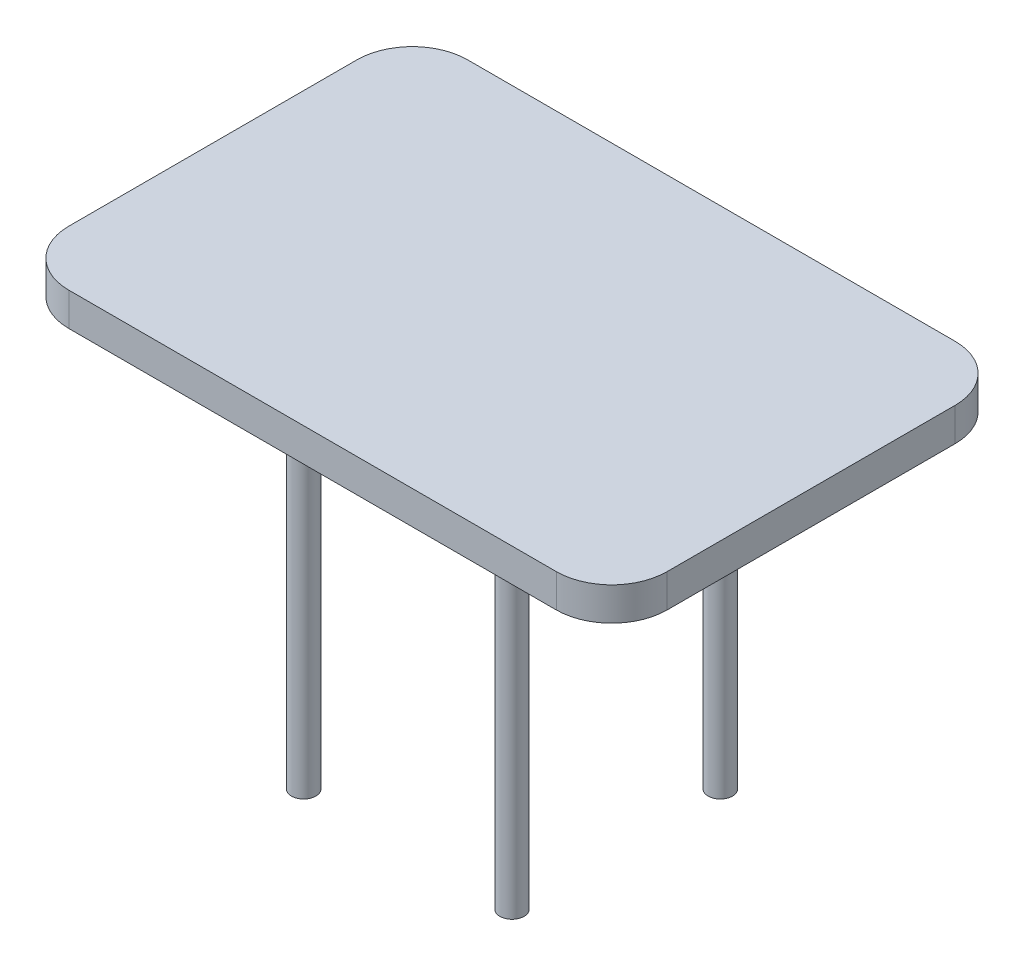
ISO-10303-21;
HEADER;
FILE_DESCRIPTION(('STEP AP214'),'2;1');
FILE_NAME('part.step','',(''),(''),'','','');
FILE_SCHEMA(('AUTOMOTIVE_DESIGN { 1 0 10303 214 1 1 1 1 }'));
ENDSEC;
DATA;
#1=APPLICATION_CONTEXT('core data for automotive mechanical design processes');
#2=APPLICATION_PROTOCOL_DEFINITION('international standard','automotive_design',2000,#1);
#3=PRODUCT_CONTEXT('',#1,'mechanical');
#4=PRODUCT('Part','Part','',(#3));
#5=PRODUCT_RELATED_PRODUCT_CATEGORY('part','',(#4));
#6=PRODUCT_DEFINITION_FORMATION('','',#4);
#7=PRODUCT_DEFINITION_CONTEXT('part definition',#1,'design');
#8=PRODUCT_DEFINITION('design','',#6,#7);
#9=PRODUCT_DEFINITION_SHAPE('','',#8);
#10=(LENGTH_UNIT() NAMED_UNIT(*) SI_UNIT(.MILLI.,.METRE.));
#11=(NAMED_UNIT(*) PLANE_ANGLE_UNIT() SI_UNIT($,.RADIAN.));
#12=(NAMED_UNIT(*) SI_UNIT($,.STERADIAN.) SOLID_ANGLE_UNIT());
#13=UNCERTAINTY_MEASURE_WITH_UNIT(LENGTH_MEASURE(1.E-05),#10,'distance_accuracy_value','');
#14=(GEOMETRIC_REPRESENTATION_CONTEXT(3) GLOBAL_UNCERTAINTY_ASSIGNED_CONTEXT((#13)) GLOBAL_UNIT_ASSIGNED_CONTEXT((#10,
#11,#12)) REPRESENTATION_CONTEXT('',''));
#15=CARTESIAN_POINT('',(0.,0.,0.));
#16=DIRECTION('',(0.,0.,1.));
#17=DIRECTION('',(1.,0.,0.));
#18=AXIS2_PLACEMENT_3D('',#15,#16,#17);
#19=CARTESIAN_POINT('',(-135.,-15.,90.));
#20=DIRECTION('',(0.,1.,0.));
#21=DIRECTION('',(0.,0.,1.));
#22=AXIS2_PLACEMENT_3D('',#19,#20,#21);
#23=PLANE('',#22);
#24=CARTESIAN_POINT('',(47.,-15.,47.));
#25=DIRECTION('',(0.,1.,0.));
#26=DIRECTION('',(0.,0.,1.));
#27=AXIS2_PLACEMENT_3D('',#24,#25,#26);
#28=CIRCLE('',#27,10.5);
#29=CARTESIAN_POINT('',(47.,-15.,57.5));
#30=VERTEX_POINT('',#29);
#31=EDGE_CURVE('E191',#30,#30,#28,.F.);
#32=ORIENTED_EDGE('',*,*,#31,.F.);
#33=EDGE_LOOP('',(#32));
#34=FACE_BOUND('',#33,.T.);
#35=CARTESIAN_POINT('',(-47.,-15.,-47.));
#36=DIRECTION('',(0.,1.,0.));
#37=DIRECTION('',(0.,0.,1.));
#38=AXIS2_PLACEMENT_3D('',#35,#36,#37);
#39=CIRCLE('',#38,10.5);
#40=CARTESIAN_POINT('',(-47.,-15.,-36.5));
#41=VERTEX_POINT('',#40);
#42=EDGE_CURVE('E177',#41,#41,#39,.F.);
#43=ORIENTED_EDGE('',*,*,#42,.F.);
#44=EDGE_LOOP('',(#43));
#45=FACE_BOUND('',#44,.T.);
#46=CARTESIAN_POINT('',(0.,-15.,0.));
#47=DIRECTION('',(0.,1.,0.));
#48=DIRECTION('',(0.,0.,1.));
#49=AXIS2_PLACEMENT_3D('',#46,#47,#48);
#50=CIRCLE('',#49,39.9999999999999);
#51=CARTESIAN_POINT('',(0.,-15.,39.9999999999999));
#52=VERTEX_POINT('',#51);
#53=EDGE_CURVE('E174',#52,#52,#50,.T.);
#54=ORIENTED_EDGE('',*,*,#53,.T.);
#55=EDGE_LOOP('',(#54));
#56=FACE_BOUND('',#55,.T.);
#57=DIRECTION('',(0.,0.,1.));
#58=VECTOR('',#57,1.);
#59=CARTESIAN_POINT('',(135.,-15.,-90.));
#60=LINE('',#59,#58);
#61=CARTESIAN_POINT('',(135.,-15.,-65.));
#62=VERTEX_POINT('',#61);
#63=CARTESIAN_POINT('',(135.,-15.,65.));
#64=VERTEX_POINT('',#63);
#65=EDGE_CURVE('E157',#62,#64,#60,.T.);
#66=ORIENTED_EDGE('',*,*,#65,.T.);
#67=CARTESIAN_POINT('',(110.,-15.,65.));
#68=DIRECTION('',(0.,1.,0.));
#69=DIRECTION('',(0.,0.,1.));
#70=AXIS2_PLACEMENT_3D('',#67,#68,#69);
#71=CIRCLE('',#70,25.);
#72=CARTESIAN_POINT('',(110.,-15.,90.));
#73=VERTEX_POINT('',#72);
#74=EDGE_CURVE('E144',#64,#73,#71,.F.);
#75=ORIENTED_EDGE('',*,*,#74,.T.);
#76=DIRECTION('',(1.,0.,0.));
#77=VECTOR('',#76,1.);
#78=CARTESIAN_POINT('',(-135.,-15.,90.));
#79=LINE('',#78,#77);
#80=CARTESIAN_POINT('',(-110.,-15.,90.));
#81=VERTEX_POINT('',#80);
#82=EDGE_CURVE('E154',#81,#73,#79,.T.);
#83=ORIENTED_EDGE('',*,*,#82,.F.);
#84=CARTESIAN_POINT('',(-110.,-15.,65.));
#85=DIRECTION('',(0.,1.,0.));
#86=DIRECTION('',(0.,0.,1.));
#87=AXIS2_PLACEMENT_3D('',#84,#85,#86);
#88=CIRCLE('',#87,25.);
#89=CARTESIAN_POINT('',(-135.,-15.,65.));
#90=VERTEX_POINT('',#89);
#91=EDGE_CURVE('E121',#81,#90,#88,.F.);
#92=ORIENTED_EDGE('',*,*,#91,.T.);
#93=DIRECTION('',(0.,0.,1.));
#94=VECTOR('',#93,1.);
#95=CARTESIAN_POINT('',(-135.,-15.,-90.));
#96=LINE('',#95,#94);
#97=CARTESIAN_POINT('',(-135.,-15.,-65.));
#98=VERTEX_POINT('',#97);
#99=EDGE_CURVE('E153',#98,#90,#96,.T.);
#100=ORIENTED_EDGE('',*,*,#99,.F.);
#101=CARTESIAN_POINT('',(-110.,-15.,-65.));
#102=DIRECTION('',(0.,1.,0.));
#103=DIRECTION('',(0.,0.,1.));
#104=AXIS2_PLACEMENT_3D('',#101,#102,#103);
#105=CIRCLE('',#104,25.);
#106=CARTESIAN_POINT('',(-110.,-15.,-90.));
#107=VERTEX_POINT('',#106);
#108=EDGE_CURVE('E54',#98,#107,#105,.F.);
#109=ORIENTED_EDGE('',*,*,#108,.T.);
#110=DIRECTION('',(1.,0.,0.));
#111=VECTOR('',#110,1.);
#112=CARTESIAN_POINT('',(-135.,-15.,-90.));
#113=LINE('',#112,#111);
#114=CARTESIAN_POINT('',(110.,-15.,-90.));
#115=VERTEX_POINT('',#114);
#116=EDGE_CURVE('E166',#107,#115,#113,.T.);
#117=ORIENTED_EDGE('',*,*,#116,.T.);
#118=CARTESIAN_POINT('',(110.,-15.,-65.));
#119=DIRECTION('',(0.,1.,0.));
#120=DIRECTION('',(0.,0.,1.));
#121=AXIS2_PLACEMENT_3D('',#118,#119,#120);
#122=CIRCLE('',#121,25.);
#123=EDGE_CURVE('E142',#115,#62,#122,.F.);
#124=ORIENTED_EDGE('',*,*,#123,.T.);
#125=EDGE_LOOP('',(#66,#75,#83,#92,#100,#109,#117,#124));
#126=FACE_BOUND('',#125,.T.);
#127=CARTESIAN_POINT('',(47.,-15.,-47.));
#128=DIRECTION('',(0.,1.,0.));
#129=DIRECTION('',(0.,0.,1.));
#130=AXIS2_PLACEMENT_3D('',#127,#128,#129);
#131=CIRCLE('',#130,10.5);
#132=CARTESIAN_POINT('',(47.,-15.,-36.5));
#133=VERTEX_POINT('',#132);
#134=EDGE_CURVE('E185',#133,#133,#131,.F.);
#135=ORIENTED_EDGE('',*,*,#134,.F.);
#136=EDGE_LOOP('',(#135));
#137=FACE_BOUND('',#136,.T.);
#138=CARTESIAN_POINT('',(-47.,-15.,47.));
#139=DIRECTION('',(0.,1.,0.));
#140=DIRECTION('',(0.,0.,1.));
#141=AXIS2_PLACEMENT_3D('',#138,#139,#140);
#142=CIRCLE('',#141,10.5);
#143=CARTESIAN_POINT('',(-47.,-15.,57.5));
#144=VERTEX_POINT('',#143);
#145=EDGE_CURVE('E197',#144,#144,#142,.F.);
#146=ORIENTED_EDGE('',*,*,#145,.F.);
#147=EDGE_LOOP('',(#146));
#148=FACE_BOUND('',#147,.T.);
#149=ADVANCED_FACE('F32',(#34,#45,#56,#126,#137,#148),#23,.F.);
#150=CARTESIAN_POINT('',(-135.,-15.,-90.));
#151=DIRECTION('',(-1.,0.,0.));
#152=DIRECTION('',(0.,0.,1.));
#153=AXIS2_PLACEMENT_3D('',#150,#151,#152);
#154=PLANE('',#153);
#155=DIRECTION('',(0.,0.,1.));
#156=VECTOR('',#155,1.);
#157=CARTESIAN_POINT('',(-135.,0.,-90.));
#158=LINE('',#157,#156);
#159=CARTESIAN_POINT('',(-135.,0.,-65.));
#160=VERTEX_POINT('',#159);
#161=CARTESIAN_POINT('',(-135.,0.,65.));
#162=VERTEX_POINT('',#161);
#163=EDGE_CURVE('E103',#160,#162,#158,.T.);
#164=ORIENTED_EDGE('',*,*,#163,.F.);
#165=DIRECTION('',(0.,1.,0.));
#166=VECTOR('',#165,1.);
#167=CARTESIAN_POINT('',(-135.,-15.,-65.));
#168=LINE('',#167,#166);
#169=EDGE_CURVE('E11',#160,#98,#168,.F.);
#170=ORIENTED_EDGE('',*,*,#169,.T.);
#171=ORIENTED_EDGE('',*,*,#99,.T.);
#172=DIRECTION('',(0.,1.,0.));
#173=VECTOR('',#172,1.);
#174=CARTESIAN_POINT('',(-135.,-15.,65.));
#175=LINE('',#174,#173);
#176=EDGE_CURVE('E40',#90,#162,#175,.T.);
#177=ORIENTED_EDGE('',*,*,#176,.T.);
#178=EDGE_LOOP('',(#164,#170,#171,#177));
#179=FACE_BOUND('',#178,.T.);
#180=ADVANCED_FACE('F151',(#179),#154,.T.);
#181=CARTESIAN_POINT('',(-135.,-15.,-90.));
#182=DIRECTION('',(0.,0.,1.));
#183=DIRECTION('',(1.,0.,0.));
#184=AXIS2_PLACEMENT_3D('',#181,#182,#183);
#185=PLANE('',#184);
#186=DIRECTION('',(1.,0.,0.));
#187=VECTOR('',#186,1.);
#188=CARTESIAN_POINT('',(-135.,0.,-90.));
#189=LINE('',#188,#187);
#190=CARTESIAN_POINT('',(-110.,0.,-90.));
#191=VERTEX_POINT('',#190);
#192=CARTESIAN_POINT('',(110.,0.,-90.));
#193=VERTEX_POINT('',#192);
#194=EDGE_CURVE('E155',#191,#193,#189,.T.);
#195=ORIENTED_EDGE('',*,*,#194,.T.);
#196=DIRECTION('',(0.,1.,0.));
#197=VECTOR('',#196,1.);
#198=CARTESIAN_POINT('',(110.,-15.,-90.));
#199=LINE('',#198,#197);
#200=EDGE_CURVE('E47',#193,#115,#199,.F.);
#201=ORIENTED_EDGE('',*,*,#200,.T.);
#202=ORIENTED_EDGE('',*,*,#116,.F.);
#203=DIRECTION('',(0.,1.,0.));
#204=VECTOR('',#203,1.);
#205=CARTESIAN_POINT('',(-110.,0.,-90.));
#206=LINE('',#205,#204);
#207=EDGE_CURVE('E146',#107,#191,#206,.T.);
#208=ORIENTED_EDGE('',*,*,#207,.T.);
#209=EDGE_LOOP('',(#195,#201,#202,#208));
#210=FACE_BOUND('',#209,.T.);
#211=ADVANCED_FACE('F249',(#210),#185,.F.);
#212=CARTESIAN_POINT('',(135.,-15.,-90.));
#213=DIRECTION('',(-1.,0.,0.));
#214=DIRECTION('',(0.,0.,1.));
#215=AXIS2_PLACEMENT_3D('',#212,#213,#214);
#216=PLANE('',#215);
#217=DIRECTION('',(0.,0.,1.));
#218=VECTOR('',#217,1.);
#219=CARTESIAN_POINT('',(135.,0.,-90.));
#220=LINE('',#219,#218);
#221=CARTESIAN_POINT('',(135.,0.,-65.));
#222=VERTEX_POINT('',#221);
#223=CARTESIAN_POINT('',(135.,0.,65.));
#224=VERTEX_POINT('',#223);
#225=EDGE_CURVE('E118',#222,#224,#220,.T.);
#226=ORIENTED_EDGE('',*,*,#225,.T.);
#227=DIRECTION('',(0.,1.,0.));
#228=VECTOR('',#227,1.);
#229=CARTESIAN_POINT('',(135.,-15.,65.));
#230=LINE('',#229,#228);
#231=EDGE_CURVE('E138',#224,#64,#230,.F.);
#232=ORIENTED_EDGE('',*,*,#231,.T.);
#233=ORIENTED_EDGE('',*,*,#65,.F.);
#234=DIRECTION('',(0.,1.,0.));
#235=VECTOR('',#234,1.);
#236=CARTESIAN_POINT('',(135.,-15.,-65.));
#237=LINE('',#236,#235);
#238=EDGE_CURVE('E135',#62,#222,#237,.T.);
#239=ORIENTED_EDGE('',*,*,#238,.T.);
#240=EDGE_LOOP('',(#226,#232,#233,#239));
#241=FACE_BOUND('',#240,.T.);
#242=ADVANCED_FACE('F425',(#241),#216,.F.);
#243=CARTESIAN_POINT('',(-135.,-15.,90.));
#244=DIRECTION('',(0.,0.,1.));
#245=DIRECTION('',(1.,0.,0.));
#246=AXIS2_PLACEMENT_3D('',#243,#244,#245);
#247=PLANE('',#246);
#248=ORIENTED_EDGE('',*,*,#82,.T.);
#249=DIRECTION('',(0.,1.,0.));
#250=VECTOR('',#249,1.);
#251=CARTESIAN_POINT('',(110.,0.,90.));
#252=LINE('',#251,#250);
#253=CARTESIAN_POINT('',(110.,0.,90.));
#254=VERTEX_POINT('',#253);
#255=EDGE_CURVE('E109',#73,#254,#252,.T.);
#256=ORIENTED_EDGE('',*,*,#255,.T.);
#257=DIRECTION('',(1.,0.,0.));
#258=VECTOR('',#257,1.);
#259=CARTESIAN_POINT('',(-135.,0.,90.));
#260=LINE('',#259,#258);
#261=CARTESIAN_POINT('',(-110.,0.,90.));
#262=VERTEX_POINT('',#261);
#263=EDGE_CURVE('E101',#262,#254,#260,.T.);
#264=ORIENTED_EDGE('',*,*,#263,.F.);
#265=DIRECTION('',(0.,1.,0.));
#266=VECTOR('',#265,1.);
#267=CARTESIAN_POINT('',(-110.,-15.,90.));
#268=LINE('',#267,#266);
#269=EDGE_CURVE('E115',#262,#81,#268,.F.);
#270=ORIENTED_EDGE('',*,*,#269,.T.);
#271=EDGE_LOOP('',(#248,#256,#264,#270));
#272=FACE_BOUND('',#271,.T.);
#273=ADVANCED_FACE('F114',(#272),#247,.T.);
#274=CARTESIAN_POINT('',(-135.,0.,90.));
#275=DIRECTION('',(0.,1.,0.));
#276=DIRECTION('',(0.,0.,1.));
#277=AXIS2_PLACEMENT_3D('',#274,#275,#276);
#278=PLANE('',#277);
#279=ORIENTED_EDGE('',*,*,#263,.T.);
#280=CARTESIAN_POINT('',(110.,0.,65.));
#281=DIRECTION('',(0.,1.,0.));
#282=DIRECTION('',(0.,0.,1.));
#283=AXIS2_PLACEMENT_3D('',#280,#281,#282);
#284=CIRCLE('',#283,25.);
#285=EDGE_CURVE('E133',#254,#224,#284,.T.);
#286=ORIENTED_EDGE('',*,*,#285,.T.);
#287=ORIENTED_EDGE('',*,*,#225,.F.);
#288=CARTESIAN_POINT('',(110.,0.,-65.));
#289=DIRECTION('',(0.,1.,0.));
#290=DIRECTION('',(0.,0.,1.));
#291=AXIS2_PLACEMENT_3D('',#288,#289,#290);
#292=CIRCLE('',#291,25.);
#293=EDGE_CURVE('E131',#222,#193,#292,.T.);
#294=ORIENTED_EDGE('',*,*,#293,.T.);
#295=ORIENTED_EDGE('',*,*,#194,.F.);
#296=CARTESIAN_POINT('',(-110.,0.,-65.));
#297=DIRECTION('',(0.,1.,0.));
#298=DIRECTION('',(0.,0.,1.));
#299=AXIS2_PLACEMENT_3D('',#296,#297,#298);
#300=CIRCLE('',#299,25.);
#301=EDGE_CURVE('E108',#191,#160,#300,.T.);
#302=ORIENTED_EDGE('',*,*,#301,.T.);
#303=ORIENTED_EDGE('',*,*,#163,.T.);
#304=CARTESIAN_POINT('',(-110.,0.,65.));
#305=DIRECTION('',(0.,1.,0.));
#306=DIRECTION('',(0.,0.,1.));
#307=AXIS2_PLACEMENT_3D('',#304,#305,#306);
#308=CIRCLE('',#307,25.);
#309=EDGE_CURVE('E98',#162,#262,#308,.T.);
#310=ORIENTED_EDGE('',*,*,#309,.T.);
#311=EDGE_LOOP('',(#279,#286,#287,#294,#295,#302,#303,#310));
#312=FACE_BOUND('',#311,.T.);
#313=ADVANCED_FACE('F100',(#312),#278,.T.);
#314=CARTESIAN_POINT('',(0.,-40.,0.));
#315=DIRECTION('',(0.,-1.,0.));
#316=DIRECTION('',(0.,0.,-1.));
#317=AXIS2_PLACEMENT_3D('',#314,#315,#316);
#318=PLANE('',#317);
#319=CARTESIAN_POINT('',(0.,-40.,0.));
#320=DIRECTION('',(0.,-1.,0.));
#321=DIRECTION('',(0.,0.,-1.));
#322=AXIS2_PLACEMENT_3D('',#319,#320,#321);
#323=CIRCLE('',#322,30.);
#324=CARTESIAN_POINT('',(0.,-40.,-30.));
#325=VERTEX_POINT('',#324);
#326=EDGE_CURVE('E161',#325,#325,#323,.T.);
#327=ORIENTED_EDGE('',*,*,#326,.T.);
#328=EDGE_LOOP('',(#327));
#329=FACE_BOUND('',#328,.T.);
#330=CARTESIAN_POINT('',(0.,-40.,0.));
#331=DIRECTION('',(0.,-1.,0.));
#332=DIRECTION('',(0.,0.,-1.));
#333=AXIS2_PLACEMENT_3D('',#330,#331,#332);
#334=CIRCLE('',#333,15.);
#335=CARTESIAN_POINT('',(0.,-40.,-15.));
#336=VERTEX_POINT('',#335);
#337=EDGE_CURVE('E273',#336,#336,#334,.T.);
#338=ORIENTED_EDGE('',*,*,#337,.F.);
#339=EDGE_LOOP('',(#338));
#340=FACE_BOUND('',#339,.T.);
#341=ADVANCED_FACE('F335',(#329,#340),#318,.T.);
#342=CARTESIAN_POINT('',(0.,-40.,0.));
#343=DIRECTION('',(0.,1.,0.));
#344=DIRECTION('',(0.,0.,1.));
#345=AXIS2_PLACEMENT_3D('',#342,#343,#344);
#346=CYLINDRICAL_SURFACE('',#345,30.);
#347=CARTESIAN_POINT('',(0.,-25.,0.));
#348=DIRECTION('',(0.,1.,0.));
#349=DIRECTION('',(0.,0.,1.));
#350=AXIS2_PLACEMENT_3D('',#347,#348,#349);
#351=CIRCLE('',#350,30.);
#352=CARTESIAN_POINT('',(0.,-25.,30.));
#353=VERTEX_POINT('',#352);
#354=EDGE_CURVE('E168',#353,#353,#351,.F.);
#355=ORIENTED_EDGE('',*,*,#354,.T.);
#356=EDGE_LOOP('',(#355));
#357=FACE_BOUND('',#356,.T.);
#358=ORIENTED_EDGE('',*,*,#326,.F.);
#359=EDGE_LOOP('',(#358));
#360=FACE_BOUND('',#359,.T.);
#361=ADVANCED_FACE('F266',(#357,#360),#346,.T.);
#362=CARTESIAN_POINT('',(0.,-40.,0.));
#363=DIRECTION('',(0.,1.,0.));
#364=DIRECTION('',(0.,0.,1.));
#365=AXIS2_PLACEMENT_3D('',#362,#363,#364);
#366=CYLINDRICAL_SURFACE('',#365,15.);
#367=ORIENTED_EDGE('',*,*,#337,.T.);
#368=EDGE_LOOP('',(#367));
#369=FACE_BOUND('',#368,.T.);
#370=CARTESIAN_POINT('',(0.,-15.,0.));
#371=DIRECTION('',(0.,-1.,0.));
#372=DIRECTION('',(0.,0.,-1.));
#373=AXIS2_PLACEMENT_3D('',#370,#371,#372);
#374=CIRCLE('',#373,15.);
#375=CARTESIAN_POINT('',(0.,-15.,-15.));
#376=VERTEX_POINT('',#375);
#377=EDGE_CURVE('E271',#376,#376,#374,.T.);
#378=ORIENTED_EDGE('',*,*,#377,.F.);
#379=EDGE_LOOP('',(#378));
#380=FACE_BOUND('',#379,.T.);
#381=ADVANCED_FACE('F257',(#369,#380),#366,.F.);
#382=ORIENTED_EDGE('',*,*,#377,.T.);
#383=EDGE_LOOP('',(#382));
#384=FACE_BOUND('',#383,.T.);
#385=ADVANCED_FACE('F245',(#384),#23,.F.);
#386=CARTESIAN_POINT('',(0.,-25.,0.));
#387=DIRECTION('',(0.,1.,0.));
#388=DIRECTION('',(0.,0.,1.));
#389=AXIS2_PLACEMENT_3D('',#386,#387,#388);
#390=CONICAL_SURFACE('',#389,30.,0.785398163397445);
#391=ORIENTED_EDGE('',*,*,#53,.F.);
#392=EDGE_LOOP('',(#391));
#393=FACE_BOUND('',#392,.T.);
#394=ORIENTED_EDGE('',*,*,#354,.F.);
#395=EDGE_LOOP('',(#394));
#396=FACE_BOUND('',#395,.T.);
#397=ADVANCED_FACE('F256',(#393,#396),#390,.T.);
#398=CARTESIAN_POINT('',(-47.,-30.,-47.));
#399=DIRECTION('',(0.,-1.,0.));
#400=DIRECTION('',(0.,0.,-1.));
#401=AXIS2_PLACEMENT_3D('',#398,#399,#400);
#402=PLANE('',#401);
#403=CARTESIAN_POINT('',(-47.,-30.,-47.));
#404=DIRECTION('',(0.,-1.,0.));
#405=DIRECTION('',(0.,0.,-1.));
#406=AXIS2_PLACEMENT_3D('',#403,#404,#405);
#407=CIRCLE('',#406,8.50000000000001);
#408=CARTESIAN_POINT('',(-47.,-30.,-55.5));
#409=VERTEX_POINT('',#408);
#410=EDGE_CURVE('E214',#409,#409,#407,.T.);
#411=ORIENTED_EDGE('',*,*,#410,.T.);
#412=EDGE_LOOP('',(#411));
#413=FACE_BOUND('',#412,.T.);
#414=CARTESIAN_POINT('',(-47.,-30.,-47.));
#415=DIRECTION('',(0.,-1.,0.));
#416=DIRECTION('',(0.,0.,-1.));
#417=AXIS2_PLACEMENT_3D('',#414,#415,#416);
#418=CIRCLE('',#417,5.5);
#419=CARTESIAN_POINT('',(-47.,-30.,-52.5));
#420=VERTEX_POINT('',#419);
#421=EDGE_CURVE('E178',#420,#420,#418,.T.);
#422=ORIENTED_EDGE('',*,*,#421,.F.);
#423=EDGE_LOOP('',(#422));
#424=FACE_BOUND('',#423,.T.);
#425=ADVANCED_FACE('F263',(#413,#424),#402,.T.);
#426=CARTESIAN_POINT('',(-47.,-30.,-47.));
#427=DIRECTION('',(0.,1.,0.));
#428=DIRECTION('',(0.,0.,1.));
#429=AXIS2_PLACEMENT_3D('',#426,#427,#428);
#430=CYLINDRICAL_SURFACE('',#429,10.5);
#431=CARTESIAN_POINT('',(-47.,-28.,-47.));
#432=DIRECTION('',(0.,-1.,0.));
#433=DIRECTION('',(0.,0.,-1.));
#434=AXIS2_PLACEMENT_3D('',#431,#432,#433);
#435=CIRCLE('',#434,10.5);
#436=CARTESIAN_POINT('',(-47.,-28.,-57.5));
#437=VERTEX_POINT('',#436);
#438=EDGE_CURVE('E217',#437,#437,#435,.F.);
#439=ORIENTED_EDGE('',*,*,#438,.T.);
#440=EDGE_LOOP('',(#439));
#441=FACE_BOUND('',#440,.T.);
#442=ORIENTED_EDGE('',*,*,#42,.T.);
#443=EDGE_LOOP('',(#442));
#444=FACE_BOUND('',#443,.T.);
#445=ADVANCED_FACE('F303',(#441,#444),#430,.T.);
#446=CARTESIAN_POINT('',(-47.,-185.,-47.));
#447=DIRECTION('',(0.,-1.,0.));
#448=DIRECTION('',(0.,0.,-1.));
#449=AXIS2_PLACEMENT_3D('',#446,#447,#448);
#450=PLANE('',#449);
#451=CARTESIAN_POINT('',(-47.,-185.,-47.));
#452=DIRECTION('',(0.,-1.,0.));
#453=DIRECTION('',(0.,0.,-1.));
#454=AXIS2_PLACEMENT_3D('',#451,#452,#453);
#455=CIRCLE('',#454,5.5);
#456=CARTESIAN_POINT('',(-47.,-185.,-52.5));
#457=VERTEX_POINT('',#456);
#458=EDGE_CURVE('E181',#457,#457,#455,.T.);
#459=ORIENTED_EDGE('',*,*,#458,.T.);
#460=EDGE_LOOP('',(#459));
#461=FACE_BOUND('',#460,.T.);
#462=ADVANCED_FACE('F289',(#461),#450,.T.);
#463=CARTESIAN_POINT('',(-47.,-185.,-47.));
#464=DIRECTION('',(0.,1.,0.));
#465=DIRECTION('',(0.,0.,1.));
#466=AXIS2_PLACEMENT_3D('',#463,#464,#465);
#467=CYLINDRICAL_SURFACE('',#466,5.5);
#468=ORIENTED_EDGE('',*,*,#421,.T.);
#469=EDGE_LOOP('',(#468));
#470=FACE_BOUND('',#469,.T.);
#471=ORIENTED_EDGE('',*,*,#458,.F.);
#472=EDGE_LOOP('',(#471));
#473=FACE_BOUND('',#472,.T.);
#474=ADVANCED_FACE('F291',(#470,#473),#467,.T.);
#475=CARTESIAN_POINT('',(47.,-30.,-47.));
#476=DIRECTION('',(0.,-1.,0.));
#477=DIRECTION('',(0.,0.,-1.));
#478=AXIS2_PLACEMENT_3D('',#475,#476,#477);
#479=PLANE('',#478);
#480=CARTESIAN_POINT('',(47.,-30.,-47.));
#481=DIRECTION('',(0.,-1.,0.));
#482=DIRECTION('',(0.,0.,-1.));
#483=AXIS2_PLACEMENT_3D('',#480,#481,#482);
#484=CIRCLE('',#483,8.50000000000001);
#485=CARTESIAN_POINT('',(47.,-30.,-55.5));
#486=VERTEX_POINT('',#485);
#487=EDGE_CURVE('E208',#486,#486,#484,.T.);
#488=ORIENTED_EDGE('',*,*,#487,.T.);
#489=EDGE_LOOP('',(#488));
#490=FACE_BOUND('',#489,.T.);
#491=CARTESIAN_POINT('',(47.,-30.,-47.));
#492=DIRECTION('',(0.,-1.,0.));
#493=DIRECTION('',(0.,0.,-1.));
#494=AXIS2_PLACEMENT_3D('',#491,#492,#493);
#495=CIRCLE('',#494,5.5);
#496=CARTESIAN_POINT('',(47.,-30.,-52.5));
#497=VERTEX_POINT('',#496);
#498=EDGE_CURVE('E182',#497,#497,#495,.T.);
#499=ORIENTED_EDGE('',*,*,#498,.F.);
#500=EDGE_LOOP('',(#499));
#501=FACE_BOUND('',#500,.T.);
#502=ADVANCED_FACE('F293',(#490,#501),#479,.T.);
#503=CARTESIAN_POINT('',(47.,-30.,-47.));
#504=DIRECTION('',(0.,1.,0.));
#505=DIRECTION('',(0.,0.,1.));
#506=AXIS2_PLACEMENT_3D('',#503,#504,#505);
#507=CYLINDRICAL_SURFACE('',#506,10.5);
#508=CARTESIAN_POINT('',(47.,-28.,-47.));
#509=DIRECTION('',(0.,-1.,0.));
#510=DIRECTION('',(0.,0.,-1.));
#511=AXIS2_PLACEMENT_3D('',#508,#509,#510);
#512=CIRCLE('',#511,10.5);
#513=CARTESIAN_POINT('',(47.,-28.,-57.5));
#514=VERTEX_POINT('',#513);
#515=EDGE_CURVE('E211',#514,#514,#512,.F.);
#516=ORIENTED_EDGE('',*,*,#515,.T.);
#517=EDGE_LOOP('',(#516));
#518=FACE_BOUND('',#517,.T.);
#519=ORIENTED_EDGE('',*,*,#134,.T.);
#520=EDGE_LOOP('',(#519));
#521=FACE_BOUND('',#520,.T.);
#522=ADVANCED_FACE('F300',(#518,#521),#507,.T.);
#523=CARTESIAN_POINT('',(47.,-185.,-47.));
#524=DIRECTION('',(0.,-1.,0.));
#525=DIRECTION('',(0.,0.,-1.));
#526=AXIS2_PLACEMENT_3D('',#523,#524,#525);
#527=PLANE('',#526);
#528=CARTESIAN_POINT('',(47.,-185.,-47.));
#529=DIRECTION('',(0.,-1.,0.));
#530=DIRECTION('',(0.,0.,-1.));
#531=AXIS2_PLACEMENT_3D('',#528,#529,#530);
#532=CIRCLE('',#531,5.5);
#533=CARTESIAN_POINT('',(47.,-185.,-52.5));
#534=VERTEX_POINT('',#533);
#535=EDGE_CURVE('E283',#534,#534,#532,.T.);
#536=ORIENTED_EDGE('',*,*,#535,.T.);
#537=EDGE_LOOP('',(#536));
#538=FACE_BOUND('',#537,.T.);
#539=ADVANCED_FACE('F307',(#538),#527,.T.);
#540=CARTESIAN_POINT('',(47.,-185.,-47.));
#541=DIRECTION('',(0.,1.,0.));
#542=DIRECTION('',(0.,0.,1.));
#543=AXIS2_PLACEMENT_3D('',#540,#541,#542);
#544=CYLINDRICAL_SURFACE('',#543,5.5);
#545=ORIENTED_EDGE('',*,*,#498,.T.);
#546=EDGE_LOOP('',(#545));
#547=FACE_BOUND('',#546,.T.);
#548=ORIENTED_EDGE('',*,*,#535,.F.);
#549=EDGE_LOOP('',(#548));
#550=FACE_BOUND('',#549,.T.);
#551=ADVANCED_FACE('F310',(#547,#550),#544,.T.);
#552=CARTESIAN_POINT('',(47.,-30.,47.));
#553=DIRECTION('',(0.,-1.,0.));
#554=DIRECTION('',(0.,0.,-1.));
#555=AXIS2_PLACEMENT_3D('',#552,#553,#554);
#556=PLANE('',#555);
#557=CARTESIAN_POINT('',(47.,-30.,47.));
#558=DIRECTION('',(0.,-1.,0.));
#559=DIRECTION('',(0.,0.,-1.));
#560=AXIS2_PLACEMENT_3D('',#557,#558,#559);
#561=CIRCLE('',#560,8.50000000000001);
#562=CARTESIAN_POINT('',(47.,-30.,38.5));
#563=VERTEX_POINT('',#562);
#564=EDGE_CURVE('E202',#563,#563,#561,.T.);
#565=ORIENTED_EDGE('',*,*,#564,.T.);
#566=EDGE_LOOP('',(#565));
#567=FACE_BOUND('',#566,.T.);
#568=CARTESIAN_POINT('',(47.,-30.,47.));
#569=DIRECTION('',(0.,-1.,0.));
#570=DIRECTION('',(0.,0.,-1.));
#571=AXIS2_PLACEMENT_3D('',#568,#569,#570);
#572=CIRCLE('',#571,5.5);
#573=CARTESIAN_POINT('',(47.,-30.,41.5));
#574=VERTEX_POINT('',#573);
#575=EDGE_CURVE('E188',#574,#574,#572,.T.);
#576=ORIENTED_EDGE('',*,*,#575,.F.);
#577=EDGE_LOOP('',(#576));
#578=FACE_BOUND('',#577,.T.);
#579=ADVANCED_FACE('F314',(#567,#578),#556,.T.);
#580=CARTESIAN_POINT('',(47.,-30.,47.));
#581=DIRECTION('',(0.,1.,0.));
#582=DIRECTION('',(0.,0.,1.));
#583=AXIS2_PLACEMENT_3D('',#580,#581,#582);
#584=CYLINDRICAL_SURFACE('',#583,10.5);
#585=CARTESIAN_POINT('',(47.,-28.,47.));
#586=DIRECTION('',(0.,-1.,0.));
#587=DIRECTION('',(0.,0.,-1.));
#588=AXIS2_PLACEMENT_3D('',#585,#586,#587);
#589=CIRCLE('',#588,10.5);
#590=CARTESIAN_POINT('',(47.,-28.,36.5));
#591=VERTEX_POINT('',#590);
#592=EDGE_CURVE('E205',#591,#591,#589,.F.);
#593=ORIENTED_EDGE('',*,*,#592,.T.);
#594=EDGE_LOOP('',(#593));
#595=FACE_BOUND('',#594,.T.);
#596=ORIENTED_EDGE('',*,*,#31,.T.);
#597=EDGE_LOOP('',(#596));
#598=FACE_BOUND('',#597,.T.);
#599=ADVANCED_FACE('F320',(#595,#598),#584,.T.);
#600=CARTESIAN_POINT('',(47.,-185.,47.));
#601=DIRECTION('',(0.,-1.,0.));
#602=DIRECTION('',(0.,0.,-1.));
#603=AXIS2_PLACEMENT_3D('',#600,#601,#602);
#604=PLANE('',#603);
#605=CARTESIAN_POINT('',(47.,-185.,47.));
#606=DIRECTION('',(0.,-1.,0.));
#607=DIRECTION('',(0.,0.,-1.));
#608=AXIS2_PLACEMENT_3D('',#605,#606,#607);
#609=CIRCLE('',#608,5.5);
#610=CARTESIAN_POINT('',(47.,-185.,41.5));
#611=VERTEX_POINT('',#610);
#612=EDGE_CURVE('E278',#611,#611,#609,.T.);
#613=ORIENTED_EDGE('',*,*,#612,.T.);
#614=EDGE_LOOP('',(#613));
#615=FACE_BOUND('',#614,.T.);
#616=ADVANCED_FACE('F316',(#615),#604,.T.);
#617=CARTESIAN_POINT('',(47.,-185.,47.));
#618=DIRECTION('',(0.,1.,0.));
#619=DIRECTION('',(0.,0.,1.));
#620=AXIS2_PLACEMENT_3D('',#617,#618,#619);
#621=CYLINDRICAL_SURFACE('',#620,5.5);
#622=ORIENTED_EDGE('',*,*,#575,.T.);
#623=EDGE_LOOP('',(#622));
#624=FACE_BOUND('',#623,.T.);
#625=ORIENTED_EDGE('',*,*,#612,.F.);
#626=EDGE_LOOP('',(#625));
#627=FACE_BOUND('',#626,.T.);
#628=ADVANCED_FACE('F319',(#624,#627),#621,.T.);
#629=CARTESIAN_POINT('',(-47.,-30.,47.));
#630=DIRECTION('',(0.,-1.,0.));
#631=DIRECTION('',(0.,0.,-1.));
#632=AXIS2_PLACEMENT_3D('',#629,#630,#631);
#633=PLANE('',#632);
#634=CARTESIAN_POINT('',(-47.,-30.,47.));
#635=DIRECTION('',(0.,-1.,0.));
#636=DIRECTION('',(0.,0.,-1.));
#637=AXIS2_PLACEMENT_3D('',#634,#635,#636);
#638=CIRCLE('',#637,8.49999999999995);
#639=CARTESIAN_POINT('',(-47.,-30.,55.5));
#640=VERTEX_POINT('',#639);
#641=EDGE_CURVE('E126',#640,#640,#638,.T.);
#642=ORIENTED_EDGE('',*,*,#641,.T.);
#643=EDGE_LOOP('',(#642));
#644=FACE_BOUND('',#643,.T.);
#645=CARTESIAN_POINT('',(-47.,-30.,47.));
#646=DIRECTION('',(0.,-1.,0.));
#647=DIRECTION('',(0.,0.,-1.));
#648=AXIS2_PLACEMENT_3D('',#645,#646,#647);
#649=CIRCLE('',#648,5.5);
#650=CARTESIAN_POINT('',(-47.,-30.,41.5));
#651=VERTEX_POINT('',#650);
#652=EDGE_CURVE('E194',#651,#651,#649,.T.);
#653=ORIENTED_EDGE('',*,*,#652,.F.);
#654=EDGE_LOOP('',(#653));
#655=FACE_BOUND('',#654,.T.);
#656=ADVANCED_FACE('F222',(#644,#655),#633,.T.);
#657=CARTESIAN_POINT('',(-47.,-30.,47.));
#658=DIRECTION('',(0.,1.,0.));
#659=DIRECTION('',(0.,0.,1.));
#660=AXIS2_PLACEMENT_3D('',#657,#658,#659);
#661=CYLINDRICAL_SURFACE('',#660,10.5);
#662=CARTESIAN_POINT('',(-47.,-27.9999999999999,47.));
#663=DIRECTION('',(0.,-1.,0.));
#664=DIRECTION('',(0.,0.,-1.));
#665=AXIS2_PLACEMENT_3D('',#662,#663,#664);
#666=CIRCLE('',#665,10.5);
#667=CARTESIAN_POINT('',(-47.,-27.9999999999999,57.5));
#668=VERTEX_POINT('',#667);
#669=EDGE_CURVE('E122',#668,#668,#666,.F.);
#670=ORIENTED_EDGE('',*,*,#669,.T.);
#671=EDGE_LOOP('',(#670));
#672=FACE_BOUND('',#671,.T.);
#673=ORIENTED_EDGE('',*,*,#145,.T.);
#674=EDGE_LOOP('',(#673));
#675=FACE_BOUND('',#674,.T.);
#676=ADVANCED_FACE('F329',(#672,#675),#661,.T.);
#677=CARTESIAN_POINT('',(-47.,-185.,47.));
#678=DIRECTION('',(0.,-1.,0.));
#679=DIRECTION('',(0.,0.,-1.));
#680=AXIS2_PLACEMENT_3D('',#677,#678,#679);
#681=PLANE('',#680);
#682=CARTESIAN_POINT('',(-47.,-185.,47.));
#683=DIRECTION('',(0.,-1.,0.));
#684=DIRECTION('',(0.,0.,-1.));
#685=AXIS2_PLACEMENT_3D('',#682,#683,#684);
#686=CIRCLE('',#685,5.5);
#687=CARTESIAN_POINT('',(-47.,-185.,41.5));
#688=VERTEX_POINT('',#687);
#689=EDGE_CURVE('E274',#688,#688,#686,.T.);
#690=ORIENTED_EDGE('',*,*,#689,.T.);
#691=EDGE_LOOP('',(#690));
#692=FACE_BOUND('',#691,.T.);
#693=ADVANCED_FACE('F325',(#692),#681,.T.);
#694=CARTESIAN_POINT('',(-47.,-185.,47.));
#695=DIRECTION('',(0.,1.,0.));
#696=DIRECTION('',(0.,0.,1.));
#697=AXIS2_PLACEMENT_3D('',#694,#695,#696);
#698=CYLINDRICAL_SURFACE('',#697,5.5);
#699=ORIENTED_EDGE('',*,*,#652,.T.);
#700=EDGE_LOOP('',(#699));
#701=FACE_BOUND('',#700,.T.);
#702=ORIENTED_EDGE('',*,*,#689,.F.);
#703=EDGE_LOOP('',(#702));
#704=FACE_BOUND('',#703,.T.);
#705=ADVANCED_FACE('F328',(#701,#704),#698,.T.);
#706=CARTESIAN_POINT('',(47.,-30.,47.));
#707=DIRECTION('',(0.,1.,0.));
#708=DIRECTION('',(0.,0.,1.));
#709=AXIS2_PLACEMENT_3D('',#706,#707,#708);
#710=CONICAL_SURFACE('',#709,8.50000000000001,0.785398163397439);
#711=ORIENTED_EDGE('',*,*,#592,.F.);
#712=EDGE_LOOP('',(#711));
#713=FACE_BOUND('',#712,.T.);
#714=ORIENTED_EDGE('',*,*,#564,.F.);
#715=EDGE_LOOP('',(#714));
#716=FACE_BOUND('',#715,.T.);
#717=ADVANCED_FACE('F332',(#713,#716),#710,.T.);
#718=CARTESIAN_POINT('',(47.,-30.,-47.));
#719=DIRECTION('',(0.,1.,0.));
#720=DIRECTION('',(0.,0.,1.));
#721=AXIS2_PLACEMENT_3D('',#718,#719,#720);
#722=CONICAL_SURFACE('',#721,8.50000000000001,0.785398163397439);
#723=ORIENTED_EDGE('',*,*,#515,.F.);
#724=EDGE_LOOP('',(#723));
#725=FACE_BOUND('',#724,.T.);
#726=ORIENTED_EDGE('',*,*,#487,.F.);
#727=EDGE_LOOP('',(#726));
#728=FACE_BOUND('',#727,.T.);
#729=ADVANCED_FACE('F238',(#725,#728),#722,.T.);
#730=CARTESIAN_POINT('',(-47.,-30.,-47.));
#731=DIRECTION('',(0.,1.,0.));
#732=DIRECTION('',(0.,0.,1.));
#733=AXIS2_PLACEMENT_3D('',#730,#731,#732);
#734=CONICAL_SURFACE('',#733,8.50000000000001,0.785398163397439);
#735=ORIENTED_EDGE('',*,*,#438,.F.);
#736=EDGE_LOOP('',(#735));
#737=FACE_BOUND('',#736,.T.);
#738=ORIENTED_EDGE('',*,*,#410,.F.);
#739=EDGE_LOOP('',(#738));
#740=FACE_BOUND('',#739,.T.);
#741=ADVANCED_FACE('F228',(#737,#740),#734,.T.);
#742=CARTESIAN_POINT('',(-47.,-30.,47.));
#743=DIRECTION('',(0.,1.,0.));
#744=DIRECTION('',(0.,0.,1.));
#745=AXIS2_PLACEMENT_3D('',#742,#743,#744);
#746=CONICAL_SURFACE('',#745,8.49999999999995,0.785398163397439);
#747=CARTESIAN_POINT('',(-47.,-27.9999999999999,57.5));
#748=CARTESIAN_POINT('',(-47.,-28.0208333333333,57.4791666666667));
#749=CARTESIAN_POINT('',(-47.,-28.0416666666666,57.4583333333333));
#750=CARTESIAN_POINT('',(-47.,-28.0833333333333,57.4166666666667));
#751=CARTESIAN_POINT('',(-47.,-28.1041666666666,57.3958333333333));
#752=CARTESIAN_POINT('',(-47.,-28.1458333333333,57.3541666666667));
#753=CARTESIAN_POINT('',(-47.,-28.1666666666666,57.3333333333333));
#754=CARTESIAN_POINT('',(-47.,-28.2083333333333,57.2916666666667));
#755=CARTESIAN_POINT('',(-47.,-28.2291666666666,57.2708333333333));
#756=CARTESIAN_POINT('',(-47.,-28.2708333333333,57.2291666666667));
#757=CARTESIAN_POINT('',(-47.,-28.2916666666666,57.2083333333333));
#758=CARTESIAN_POINT('',(-47.,-28.3333333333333,57.1666666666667));
#759=CARTESIAN_POINT('',(-47.,-28.3541666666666,57.1458333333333));
#760=CARTESIAN_POINT('',(-47.,-28.3958333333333,57.1041666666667));
#761=CARTESIAN_POINT('',(-47.,-28.4166666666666,57.0833333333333));
#762=CARTESIAN_POINT('',(-47.,-28.4583333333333,57.0416666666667));
#763=CARTESIAN_POINT('',(-47.,-28.4791666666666,57.0208333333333));
#764=CARTESIAN_POINT('',(-47.,-28.5208333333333,56.9791666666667));
#765=CARTESIAN_POINT('',(-47.,-28.5416666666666,56.9583333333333));
#766=CARTESIAN_POINT('',(-47.,-28.5833333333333,56.9166666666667));
#767=CARTESIAN_POINT('',(-47.,-28.6041666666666,56.8958333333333));
#768=CARTESIAN_POINT('',(-47.,-28.6458333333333,56.8541666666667));
#769=CARTESIAN_POINT('',(-47.,-28.6666666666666,56.8333333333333));
#770=CARTESIAN_POINT('',(-47.,-28.7083333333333,56.7916666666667));
#771=CARTESIAN_POINT('',(-47.,-28.7291666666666,56.7708333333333));
#772=CARTESIAN_POINT('',(-47.,-28.7708333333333,56.7291666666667));
#773=CARTESIAN_POINT('',(-47.,-28.7916666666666,56.7083333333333));
#774=CARTESIAN_POINT('',(-47.,-28.8333333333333,56.6666666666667));
#775=CARTESIAN_POINT('',(-47.,-28.8541666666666,56.6458333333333));
#776=CARTESIAN_POINT('',(-47.,-28.8958333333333,56.6041666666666));
#777=CARTESIAN_POINT('',(-47.,-28.9166666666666,56.5833333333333));
#778=CARTESIAN_POINT('',(-47.,-28.9583333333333,56.5416666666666));
#779=CARTESIAN_POINT('',(-47.,-28.9791666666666,56.5208333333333));
#780=CARTESIAN_POINT('',(-47.,-29.0208333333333,56.4791666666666));
#781=CARTESIAN_POINT('',(-47.,-29.0416666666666,56.4583333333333));
#782=CARTESIAN_POINT('',(-47.,-29.0833333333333,56.4166666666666));
#783=CARTESIAN_POINT('',(-47.,-29.1041666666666,56.3958333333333));
#784=CARTESIAN_POINT('',(-47.,-29.1458333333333,56.3541666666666));
#785=CARTESIAN_POINT('',(-47.,-29.1666666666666,56.3333333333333));
#786=CARTESIAN_POINT('',(-47.,-29.2083333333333,56.2916666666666));
#787=CARTESIAN_POINT('',(-47.,-29.2291666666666,56.2708333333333));
#788=CARTESIAN_POINT('',(-47.,-29.2708333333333,56.2291666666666));
#789=CARTESIAN_POINT('',(-47.,-29.2916666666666,56.2083333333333));
#790=CARTESIAN_POINT('',(-47.,-29.3333333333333,56.1666666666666));
#791=CARTESIAN_POINT('',(-47.,-29.3541666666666,56.1458333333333));
#792=CARTESIAN_POINT('',(-47.,-29.3958333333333,56.1041666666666));
#793=CARTESIAN_POINT('',(-47.,-29.4166666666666,56.0833333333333));
#794=CARTESIAN_POINT('',(-47.,-29.4583333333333,56.0416666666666));
#795=CARTESIAN_POINT('',(-47.,-29.4791666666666,56.0208333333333));
#796=CARTESIAN_POINT('',(-47.,-29.5208333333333,55.9791666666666));
#797=CARTESIAN_POINT('',(-47.,-29.5416666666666,55.9583333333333));
#798=CARTESIAN_POINT('',(-47.,-29.5833333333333,55.9166666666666));
#799=CARTESIAN_POINT('',(-47.,-29.6041666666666,55.8958333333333));
#800=CARTESIAN_POINT('',(-47.,-29.6458333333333,55.8541666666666));
#801=CARTESIAN_POINT('',(-47.,-29.6666666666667,55.8333333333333));
#802=CARTESIAN_POINT('',(-47.,-29.7083333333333,55.7916666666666));
#803=CARTESIAN_POINT('',(-47.,-29.7291666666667,55.7708333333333));
#804=CARTESIAN_POINT('',(-47.,-29.7708333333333,55.7291666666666));
#805=CARTESIAN_POINT('',(-47.,-29.7916666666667,55.7083333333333));
#806=CARTESIAN_POINT('',(-47.,-29.8333333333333,55.6666666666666));
#807=CARTESIAN_POINT('',(-47.,-29.8541666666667,55.6458333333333));
#808=CARTESIAN_POINT('',(-47.,-29.8958333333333,55.6041666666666));
#809=CARTESIAN_POINT('',(-47.,-29.9166666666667,55.5833333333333));
#810=CARTESIAN_POINT('',(-47.,-29.9583333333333,55.5416666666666));
#811=CARTESIAN_POINT('',(-47.,-29.9791666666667,55.5208333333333));
#812=CARTESIAN_POINT('',(-47.,-30.,55.5));
#813=B_SPLINE_CURVE_WITH_KNOTS('',3,(#747,#748,#749,#750,#751,#752,#753,#754,#755,#756,#757,
#758,#759,#760,#761,#762,#763,#764,#765,#766,#767,#768,#769,#770,#771,#772,#773,#774,#775,#776,
#777,#778,#779,#780,#781,#782,#783,#784,#785,#786,#787,#788,#789,#790,#791,#792,#793,#794,#795,
#796,#797,#798,#799,#800,#801,#802,#803,#804,#805,#806,#807,#808,#809,#810,#811,#812),
.UNSPECIFIED.,.F.,.F.,(4,2,2,2,2,2,2,2,2,2,2,2,2,2,2,2,2,2,2,2,2,2,2,2,2,2,2,2,2,2,2,2,4),(0.,
0.088388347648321,0.176776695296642,0.265165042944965,0.353553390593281,0.441941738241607,
0.530330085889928,0.618718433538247,0.707106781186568,0.795495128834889,0.883883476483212,
0.972271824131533,1.06066017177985,1.14904851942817,1.23743686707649,1.32582521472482,
1.41421356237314,1.50260191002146,1.59099025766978,1.6793786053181,1.76776695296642,
1.85615530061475,1.94454364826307,2.03293199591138,2.12132034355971,2.20970869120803,
2.29809703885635,2.38648538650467,2.47487373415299,2.56326208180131,2.65165042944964,
2.74003877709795,2.82842712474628),.UNSPECIFIED.);
#814=EDGE_CURVE('BSEAM225',#668,#640,#813,.T.);
#815=ORIENTED_EDGE('',*,*,#669,.F.);
#816=ORIENTED_EDGE('',*,*,#641,.F.);
#817=ORIENTED_EDGE('',*,*,#814,.T.);
#818=ORIENTED_EDGE('',*,*,#814,.F.);
#819=EDGE_LOOP('',(#815,#817,#816,#818));
#820=FACE_BOUND('',#819,.T.);
#821=ADVANCED_FACE('F225',(#820),#746,.T.);
#822=CARTESIAN_POINT('',(110.,-15.,65.));
#823=DIRECTION('',(0.,-1.,0.));
#824=DIRECTION('',(0.,0.,-1.));
#825=AXIS2_PLACEMENT_3D('',#822,#823,#824);
#826=CYLINDRICAL_SURFACE('',#825,25.);
#827=ORIENTED_EDGE('',*,*,#74,.F.);
#828=ORIENTED_EDGE('',*,*,#231,.F.);
#829=ORIENTED_EDGE('',*,*,#285,.F.);
#830=ORIENTED_EDGE('',*,*,#255,.F.);
#831=EDGE_LOOP('',(#827,#828,#829,#830));
#832=FACE_BOUND('',#831,.T.);
#833=ADVANCED_FACE('F227',(#832),#826,.T.);
#834=CARTESIAN_POINT('',(110.,-15.,-65.));
#835=DIRECTION('',(0.,1.,0.));
#836=DIRECTION('',(0.,0.,1.));
#837=AXIS2_PLACEMENT_3D('',#834,#835,#836);
#838=CYLINDRICAL_SURFACE('',#837,25.);
#839=ORIENTED_EDGE('',*,*,#123,.F.);
#840=ORIENTED_EDGE('',*,*,#200,.F.);
#841=ORIENTED_EDGE('',*,*,#293,.F.);
#842=ORIENTED_EDGE('',*,*,#238,.F.);
#843=EDGE_LOOP('',(#839,#840,#841,#842));
#844=FACE_BOUND('',#843,.T.);
#845=ADVANCED_FACE('F235',(#844),#838,.T.);
#846=CARTESIAN_POINT('',(-110.,-15.,-65.));
#847=DIRECTION('',(0.,-1.,0.));
#848=DIRECTION('',(0.,0.,-1.));
#849=AXIS2_PLACEMENT_3D('',#846,#847,#848);
#850=CYLINDRICAL_SURFACE('',#849,25.);
#851=ORIENTED_EDGE('',*,*,#108,.F.);
#852=ORIENTED_EDGE('',*,*,#169,.F.);
#853=ORIENTED_EDGE('',*,*,#301,.F.);
#854=ORIENTED_EDGE('',*,*,#207,.F.);
#855=EDGE_LOOP('',(#851,#852,#853,#854));
#856=FACE_BOUND('',#855,.T.);
#857=ADVANCED_FACE('F398',(#856),#850,.T.);
#858=CARTESIAN_POINT('',(-110.,-15.,65.));
#859=DIRECTION('',(0.,1.,0.));
#860=DIRECTION('',(0.,0.,1.));
#861=AXIS2_PLACEMENT_3D('',#858,#859,#860);
#862=CYLINDRICAL_SURFACE('',#861,25.);
#863=ORIENTED_EDGE('',*,*,#91,.F.);
#864=ORIENTED_EDGE('',*,*,#269,.F.);
#865=ORIENTED_EDGE('',*,*,#309,.F.);
#866=ORIENTED_EDGE('',*,*,#176,.F.);
#867=EDGE_LOOP('',(#863,#864,#865,#866));
#868=FACE_BOUND('',#867,.T.);
#869=ADVANCED_FACE('F34',(#868),#862,.T.);
#870=CLOSED_SHELL('',(#149,#180,#211,#242,#273,#313,#341,#361,#381,#385,#397,#425,#445,#462,
#474,#502,#522,#539,#551,#579,#599,#616,#628,#656,#676,#693,#705,#717,#729,#741,#821,#833,#845,
#857,#869));
#871=MANIFOLD_SOLID_BREP('B2',#870);
#872=ADVANCED_BREP_SHAPE_REPRESENTATION('',(#18,#871),#14);
#873=SHAPE_DEFINITION_REPRESENTATION(#9,#872);
ENDSEC;
END-ISO-10303-21;
